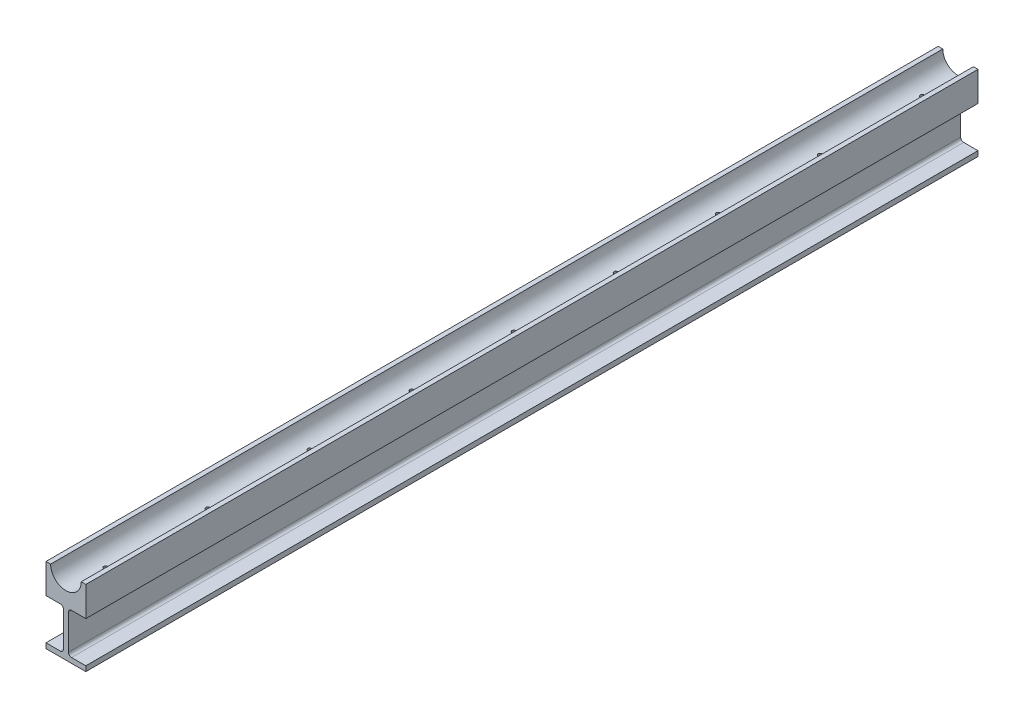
from build123d import *

# Parameters (mm, degrees)
EXTRUSION1_DEPTH           = 1748
TROU_TARAUD_M61_D          = 5
TROU_TARAUD_M61_DEPTH      = 26
TROU_TARAUD_M61_TIP        = 1.502151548
ESQUISSE5_R                = 4
ENL_V_MAT_EXTRU_1_DEPTH    = 40
R_P_TITION_LIN_AIRE1_COUNT = 9
R_P_TITION_LIN_AIRE1_PITCH = 200


with BuildPart() as part:
    # Esquisse1 → Extrusion1 (new body)
    with BuildSketch(Plane.XY):
        with BuildLine():
            Line((0, 0), (9, 0))
            ThreePointArc((9, 0), (39, -30), (69, 0))
            Line((69, 0), (78, 0))
            Line((78, 0), (78, -58))
            Line((78, -58), (50, -58))
            ThreePointArc((50, -58), (45.757359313, -59.757359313), (44, -64))
            Line((44, -64), (44, -132))
            ThreePointArc((44, -132), (45.757359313, -136.242640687), (50, -138))
            Line((50, -138), (78, -138))
            Line((78, -138), (78, -148))
            Line((78, -148), (0, -148))
            Line((0, -148), (0, -138))
            Line((0, -138), (28, -138))
            ThreePointArc((28, -138), (32.242640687, -136.242640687), (34, -132))
            Line((34, -132), (34, -64))
            ThreePointArc((34, -64), (32.242640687, -59.757359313), (28, -58))
            Line((28, -58), (0, -58))
            Line((0, -58), (0, 0))
        make_face()
    extrude(amount=EXTRUSION1_DEPTH)

    # Trou taraud_ M61
    with Locations(Plane.ZY):
        with Locations((338, -36), (380, -36), (1374, -36), (1416, -36)):
            Hole(TROU_TARAUD_M61_D / 2, depth=TROU_TARAUD_M61_DEPTH)
            with Locations((0, 0, -(TROU_TARAUD_M61_DEPTH + TROU_TARAUD_M61_TIP / 2))):  # 118° drill point
                Cone(0, TROU_TARAUD_M61_D / 2, TROU_TARAUD_M61_TIP, mode=Mode.SUBTRACT)

    # Esquisse5 → Enl_v. mat.-Extru.1 (cut)
    with BuildSketch(Plane(origin=(0, 0, 0), x_dir=(1, 0, 0), z_dir=(0, 1, 0))):
        with Locations(Location((39, -70, 0), (0, 0, 270))):
            Circle(ESQUISSE5_R)
    enl_v_mat_extru_1 = extrude(amount=-ENL_V_MAT_EXTRU_1_DEPTH, mode=Mode.SUBTRACT)

    # R_p_tition lin_aire1: Enl_v. mat.-Extru.1 ×9
    with Locations(*[(0, 0, i * R_P_TITION_LIN_AIRE1_PITCH) for i in range(1, R_P_TITION_LIN_AIRE1_COUNT)]):
        add(enl_v_mat_extru_1, mode=Mode.SUBTRACT)


solid = part.part
